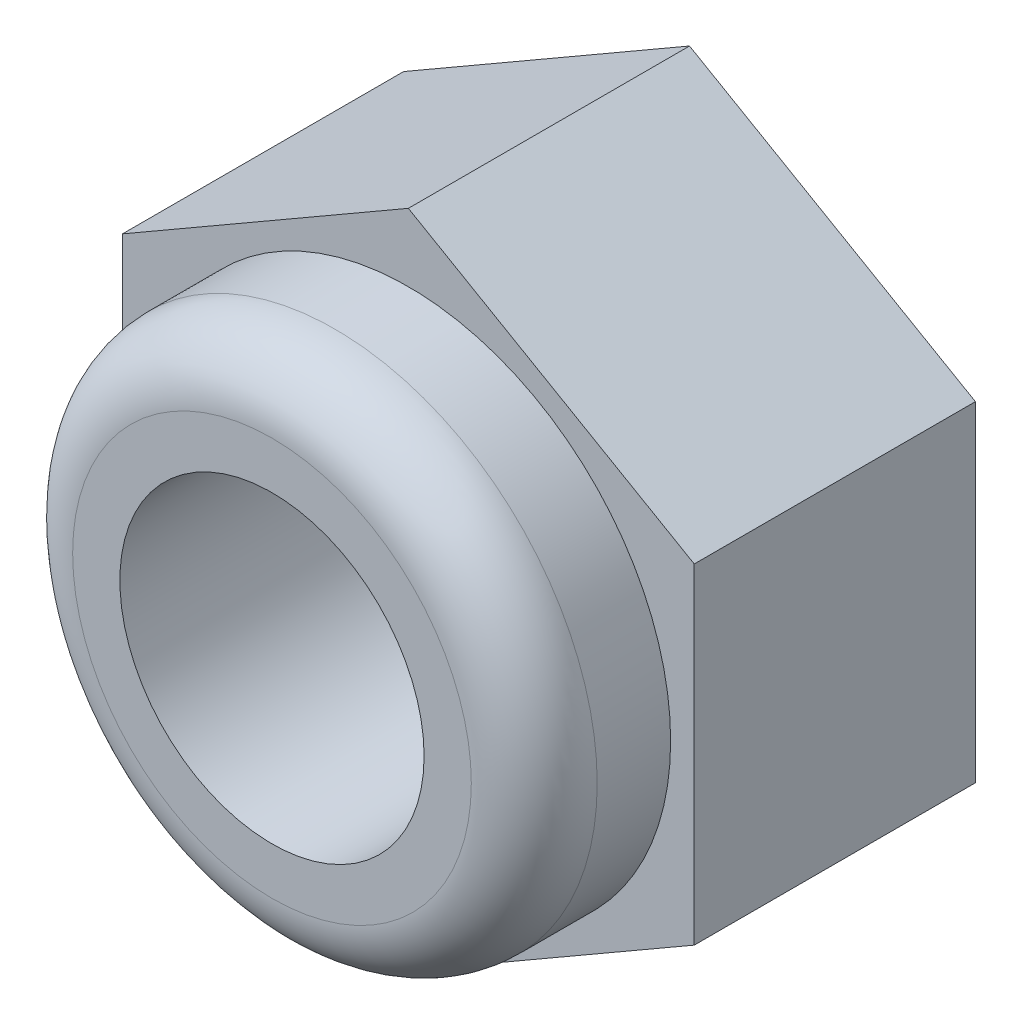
ISO-10303-21;
HEADER;
FILE_DESCRIPTION(('STEP AP214'),'2;1');
FILE_NAME('part.step','',(''),(''),'','','');
FILE_SCHEMA(('AUTOMOTIVE_DESIGN { 1 0 10303 214 1 1 1 1 }'));
ENDSEC;
DATA;
#1=APPLICATION_CONTEXT('core data for automotive mechanical design processes');
#2=APPLICATION_PROTOCOL_DEFINITION('international standard','automotive_design',2000,#1);
#3=PRODUCT_CONTEXT('',#1,'mechanical');
#4=PRODUCT('Part','Part','',(#3));
#5=PRODUCT_RELATED_PRODUCT_CATEGORY('part','',(#4));
#6=PRODUCT_DEFINITION_FORMATION('','',#4);
#7=PRODUCT_DEFINITION_CONTEXT('part definition',#1,'design');
#8=PRODUCT_DEFINITION('design','',#6,#7);
#9=PRODUCT_DEFINITION_SHAPE('','',#8);
#10=(LENGTH_UNIT() NAMED_UNIT(*) SI_UNIT(.MILLI.,.METRE.));
#11=(NAMED_UNIT(*) PLANE_ANGLE_UNIT() SI_UNIT($,.RADIAN.));
#12=(NAMED_UNIT(*) SI_UNIT($,.STERADIAN.) SOLID_ANGLE_UNIT());
#13=UNCERTAINTY_MEASURE_WITH_UNIT(LENGTH_MEASURE(1.E-05),#10,'distance_accuracy_value','');
#14=(GEOMETRIC_REPRESENTATION_CONTEXT(3) GLOBAL_UNCERTAINTY_ASSIGNED_CONTEXT((#13)) GLOBAL_UNIT_ASSIGNED_CONTEXT((#10,
#11,#12)) REPRESENTATION_CONTEXT('',''));
#15=CARTESIAN_POINT('',(0.,0.,0.));
#16=DIRECTION('',(0.,0.,1.));
#17=DIRECTION('',(1.,0.,0.));
#18=AXIS2_PLACEMENT_3D('',#15,#16,#17);
#19=CARTESIAN_POINT('',(-2.725,4.71983845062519,2.68));
#20=DIRECTION('',(0.,0.,1.));
#21=DIRECTION('',(1.,0.,0.));
#22=AXIS2_PLACEMENT_3D('',#19,#20,#21);
#23=PLANE('',#22);
#24=DIRECTION('',(-0.866025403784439,0.5,0.));
#25=VECTOR('',#24,1.);
#26=CARTESIAN_POINT('',(2.725,1.57327948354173,2.68));
#27=LINE('',#26,#25);
#28=CARTESIAN_POINT('',(2.725,1.57327948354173,2.68));
#29=VERTEX_POINT('',#28);
#30=CARTESIAN_POINT('',(0.,3.14655896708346,2.68));
#31=VERTEX_POINT('',#30);
#32=EDGE_CURVE('E134',#29,#31,#27,.T.);
#33=ORIENTED_EDGE('',*,*,#32,.T.);
#34=DIRECTION('',(-0.866025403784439,-0.5,0.));
#35=VECTOR('',#34,1.);
#36=CARTESIAN_POINT('',(0.,3.14655896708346,2.68));
#37=LINE('',#36,#35);
#38=CARTESIAN_POINT('',(-2.725,1.57327948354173,2.68));
#39=VERTEX_POINT('',#38);
#40=EDGE_CURVE('E92',#31,#39,#37,.T.);
#41=ORIENTED_EDGE('',*,*,#40,.T.);
#42=DIRECTION('',(0.,-1.,0.));
#43=VECTOR('',#42,1.);
#44=CARTESIAN_POINT('',(-2.725,1.57327948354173,2.68));
#45=LINE('',#44,#43);
#46=CARTESIAN_POINT('',(-2.725,-1.57327948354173,2.68));
#47=VERTEX_POINT('',#46);
#48=EDGE_CURVE('E105',#39,#47,#45,.T.);
#49=ORIENTED_EDGE('',*,*,#48,.T.);
#50=DIRECTION('',(0.866025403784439,-0.5,0.));
#51=VECTOR('',#50,1.);
#52=CARTESIAN_POINT('',(-2.725,-1.57327948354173,2.68));
#53=LINE('',#52,#51);
#54=CARTESIAN_POINT('',(0.,-3.14655896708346,2.68));
#55=VERTEX_POINT('',#54);
#56=EDGE_CURVE('E99',#47,#55,#53,.T.);
#57=ORIENTED_EDGE('',*,*,#56,.T.);
#58=DIRECTION('',(0.866025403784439,0.5,0.));
#59=VECTOR('',#58,1.);
#60=CARTESIAN_POINT('',(0.,-3.14655896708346,2.68));
#61=LINE('',#60,#59);
#62=CARTESIAN_POINT('',(2.725,-1.57327948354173,2.68));
#63=VERTEX_POINT('',#62);
#64=EDGE_CURVE('E103',#55,#63,#61,.T.);
#65=ORIENTED_EDGE('',*,*,#64,.T.);
#66=DIRECTION('',(0.,1.,0.));
#67=VECTOR('',#66,1.);
#68=CARTESIAN_POINT('',(2.725,-1.57327948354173,2.68));
#69=LINE('',#68,#67);
#70=EDGE_CURVE('E54',#63,#29,#69,.T.);
#71=ORIENTED_EDGE('',*,*,#70,.T.);
#72=EDGE_LOOP('',(#33,#41,#49,#57,#65,#71));
#73=FACE_BOUND('',#72,.T.);
#74=CARTESIAN_POINT('',(0.,0.,2.68));
#75=DIRECTION('',(0.,0.,1.));
#76=DIRECTION('',(1.,0.,0.));
#77=AXIS2_PLACEMENT_3D('',#74,#75,#76);
#78=CIRCLE('',#77,2.5);
#79=CARTESIAN_POINT('',(2.5,0.,2.68));
#80=VERTEX_POINT('',#79);
#81=EDGE_CURVE('E196',#80,#80,#78,.T.);
#82=ORIENTED_EDGE('',*,*,#81,.F.);
#83=EDGE_LOOP('',(#82));
#84=FACE_BOUND('',#83,.T.);
#85=ADVANCED_FACE('F37',(#73,#84),#23,.T.);
#86=CARTESIAN_POINT('',(-2.725,4.71983845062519,0.));
#87=DIRECTION('',(0.,0.,1.));
#88=DIRECTION('',(1.,0.,0.));
#89=AXIS2_PLACEMENT_3D('',#86,#87,#88);
#90=PLANE('',#89);
#91=DIRECTION('',(-0.866025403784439,0.5,0.));
#92=VECTOR('',#91,1.);
#93=CARTESIAN_POINT('',(2.725,1.57327948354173,0.));
#94=LINE('',#93,#92);
#95=CARTESIAN_POINT('',(2.725,1.57327948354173,0.));
#96=VERTEX_POINT('',#95);
#97=CARTESIAN_POINT('',(0.,3.14655896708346,0.));
#98=VERTEX_POINT('',#97);
#99=EDGE_CURVE('E123',#96,#98,#94,.T.);
#100=ORIENTED_EDGE('',*,*,#99,.F.);
#101=DIRECTION('',(0.,1.,0.));
#102=VECTOR('',#101,1.);
#103=CARTESIAN_POINT('',(2.725,-1.57327948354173,0.));
#104=LINE('',#103,#102);
#105=CARTESIAN_POINT('',(2.725,-1.57327948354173,0.));
#106=VERTEX_POINT('',#105);
#107=EDGE_CURVE('E83',#106,#96,#104,.T.);
#108=ORIENTED_EDGE('',*,*,#107,.F.);
#109=DIRECTION('',(0.866025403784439,0.5,0.));
#110=VECTOR('',#109,1.);
#111=CARTESIAN_POINT('',(0.,-3.14655896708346,0.));
#112=LINE('',#111,#110);
#113=CARTESIAN_POINT('',(0.,-3.14655896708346,0.));
#114=VERTEX_POINT('',#113);
#115=EDGE_CURVE('E77',#114,#106,#112,.T.);
#116=ORIENTED_EDGE('',*,*,#115,.F.);
#117=DIRECTION('',(0.866025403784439,-0.5,0.));
#118=VECTOR('',#117,1.);
#119=CARTESIAN_POINT('',(-2.725,-1.57327948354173,0.));
#120=LINE('',#119,#118);
#121=CARTESIAN_POINT('',(-2.725,-1.57327948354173,0.));
#122=VERTEX_POINT('',#121);
#123=EDGE_CURVE('E113',#122,#114,#120,.T.);
#124=ORIENTED_EDGE('',*,*,#123,.F.);
#125=DIRECTION('',(0.,-1.,0.));
#126=VECTOR('',#125,1.);
#127=CARTESIAN_POINT('',(-2.725,1.57327948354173,0.));
#128=LINE('',#127,#126);
#129=CARTESIAN_POINT('',(-2.725,1.57327948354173,0.));
#130=VERTEX_POINT('',#129);
#131=EDGE_CURVE('E129',#130,#122,#128,.T.);
#132=ORIENTED_EDGE('',*,*,#131,.F.);
#133=DIRECTION('',(-0.866025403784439,-0.5,0.));
#134=VECTOR('',#133,1.);
#135=CARTESIAN_POINT('',(0.,3.14655896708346,0.));
#136=LINE('',#135,#134);
#137=EDGE_CURVE('E126',#98,#130,#136,.T.);
#138=ORIENTED_EDGE('',*,*,#137,.F.);
#139=EDGE_LOOP('',(#100,#108,#116,#124,#132,#138));
#140=FACE_BOUND('',#139,.T.);
#141=CARTESIAN_POINT('',(0.,0.,0.));
#142=DIRECTION('',(0.,0.,1.));
#143=DIRECTION('',(1.,0.,0.));
#144=AXIS2_PLACEMENT_3D('',#141,#142,#143);
#145=CIRCLE('',#144,1.45);
#146=CARTESIAN_POINT('',(1.45,0.,0.));
#147=VERTEX_POINT('',#146);
#148=EDGE_CURVE('E127',#147,#147,#145,.T.);
#149=ORIENTED_EDGE('',*,*,#148,.T.);
#150=EDGE_LOOP('',(#149));
#151=FACE_BOUND('',#150,.T.);
#152=ADVANCED_FACE('F158',(#140,#151),#90,.F.);
#153=CARTESIAN_POINT('',(2.725,1.57327948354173,2.68));
#154=DIRECTION('',(-0.5,-0.866025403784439,0.));
#155=DIRECTION('',(0.866025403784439,-0.5,0.));
#156=AXIS2_PLACEMENT_3D('',#153,#154,#155);
#157=PLANE('',#156);
#158=ORIENTED_EDGE('',*,*,#99,.T.);
#159=DIRECTION('',(0.,0.,-1.));
#160=VECTOR('',#159,1.);
#161=CARTESIAN_POINT('',(0.,3.14655896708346,2.68));
#162=LINE('',#161,#160);
#163=EDGE_CURVE('E141',#31,#98,#162,.T.);
#164=ORIENTED_EDGE('',*,*,#163,.F.);
#165=ORIENTED_EDGE('',*,*,#32,.F.);
#166=DIRECTION('',(0.,0.,-1.));
#167=VECTOR('',#166,1.);
#168=CARTESIAN_POINT('',(2.725,1.57327948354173,2.68));
#169=LINE('',#168,#167);
#170=EDGE_CURVE('E119',#29,#96,#169,.T.);
#171=ORIENTED_EDGE('',*,*,#170,.T.);
#172=EDGE_LOOP('',(#158,#164,#165,#171));
#173=FACE_BOUND('',#172,.T.);
#174=ADVANCED_FACE('F163',(#173),#157,.F.);
#175=CARTESIAN_POINT('',(0.,3.14655896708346,2.68));
#176=DIRECTION('',(0.5,-0.866025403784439,0.));
#177=DIRECTION('',(0.866025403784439,0.5,0.));
#178=AXIS2_PLACEMENT_3D('',#175,#176,#177);
#179=PLANE('',#178);
#180=ORIENTED_EDGE('',*,*,#137,.T.);
#181=DIRECTION('',(0.,0.,-1.));
#182=VECTOR('',#181,1.);
#183=CARTESIAN_POINT('',(-2.725,1.57327948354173,2.68));
#184=LINE('',#183,#182);
#185=EDGE_CURVE('E138',#39,#130,#184,.T.);
#186=ORIENTED_EDGE('',*,*,#185,.F.);
#187=ORIENTED_EDGE('',*,*,#40,.F.);
#188=ORIENTED_EDGE('',*,*,#163,.T.);
#189=EDGE_LOOP('',(#180,#186,#187,#188));
#190=FACE_BOUND('',#189,.T.);
#191=ADVANCED_FACE('F179',(#190),#179,.F.);
#192=CARTESIAN_POINT('',(-2.725,1.57327948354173,2.68));
#193=DIRECTION('',(1.,0.,0.));
#194=DIRECTION('',(0.,1.,0.));
#195=AXIS2_PLACEMENT_3D('',#192,#193,#194);
#196=PLANE('',#195);
#197=ORIENTED_EDGE('',*,*,#131,.T.);
#198=DIRECTION('',(0.,0.,-1.));
#199=VECTOR('',#198,1.);
#200=CARTESIAN_POINT('',(-2.725,-1.57327948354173,2.68));
#201=LINE('',#200,#199);
#202=EDGE_CURVE('E114',#47,#122,#201,.T.);
#203=ORIENTED_EDGE('',*,*,#202,.F.);
#204=ORIENTED_EDGE('',*,*,#48,.F.);
#205=ORIENTED_EDGE('',*,*,#185,.T.);
#206=EDGE_LOOP('',(#197,#203,#204,#205));
#207=FACE_BOUND('',#206,.T.);
#208=ADVANCED_FACE('F176',(#207),#196,.F.);
#209=CARTESIAN_POINT('',(-2.725,-1.57327948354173,2.68));
#210=DIRECTION('',(0.5,0.866025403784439,0.));
#211=DIRECTION('',(-0.866025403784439,0.5,0.));
#212=AXIS2_PLACEMENT_3D('',#209,#210,#211);
#213=PLANE('',#212);
#214=ORIENTED_EDGE('',*,*,#123,.T.);
#215=DIRECTION('',(0.,0.,-1.));
#216=VECTOR('',#215,1.);
#217=CARTESIAN_POINT('',(0.,-3.14655896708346,2.68));
#218=LINE('',#217,#216);
#219=EDGE_CURVE('E110',#55,#114,#218,.T.);
#220=ORIENTED_EDGE('',*,*,#219,.F.);
#221=ORIENTED_EDGE('',*,*,#56,.F.);
#222=ORIENTED_EDGE('',*,*,#202,.T.);
#223=EDGE_LOOP('',(#214,#220,#221,#222));
#224=FACE_BOUND('',#223,.T.);
#225=ADVANCED_FACE('F111',(#224),#213,.F.);
#226=CARTESIAN_POINT('',(0.,-3.14655896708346,2.68));
#227=DIRECTION('',(-0.5,0.866025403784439,0.));
#228=DIRECTION('',(-0.866025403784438,-0.5,0.));
#229=AXIS2_PLACEMENT_3D('',#226,#227,#228);
#230=PLANE('',#229);
#231=ORIENTED_EDGE('',*,*,#115,.T.);
#232=DIRECTION('',(0.,0.,-1.));
#233=VECTOR('',#232,1.);
#234=CARTESIAN_POINT('',(2.725,-1.57327948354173,2.68));
#235=LINE('',#234,#233);
#236=EDGE_CURVE('E115',#63,#106,#235,.T.);
#237=ORIENTED_EDGE('',*,*,#236,.F.);
#238=ORIENTED_EDGE('',*,*,#64,.F.);
#239=ORIENTED_EDGE('',*,*,#219,.T.);
#240=EDGE_LOOP('',(#231,#237,#238,#239));
#241=FACE_BOUND('',#240,.T.);
#242=ADVANCED_FACE('F117',(#241),#230,.F.);
#243=CARTESIAN_POINT('',(2.725,-1.57327948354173,2.68));
#244=DIRECTION('',(-1.,0.,0.));
#245=DIRECTION('',(0.,0.,1.));
#246=AXIS2_PLACEMENT_3D('',#243,#244,#245);
#247=PLANE('',#246);
#248=ORIENTED_EDGE('',*,*,#107,.T.);
#249=ORIENTED_EDGE('',*,*,#170,.F.);
#250=ORIENTED_EDGE('',*,*,#70,.F.);
#251=ORIENTED_EDGE('',*,*,#236,.T.);
#252=EDGE_LOOP('',(#248,#249,#250,#251));
#253=FACE_BOUND('',#252,.T.);
#254=ADVANCED_FACE('F169',(#253),#247,.F.);
#255=CARTESIAN_POINT('',(0.,0.,2.68));
#256=DIRECTION('',(0.,0.,-1.));
#257=DIRECTION('',(-1.,0.,0.));
#258=AXIS2_PLACEMENT_3D('',#255,#256,#257);
#259=CYLINDRICAL_SURFACE('',#258,1.45);
#260=ORIENTED_EDGE('',*,*,#148,.F.);
#261=EDGE_LOOP('',(#260));
#262=FACE_BOUND('',#261,.T.);
#263=CARTESIAN_POINT('',(0.,0.,3.98));
#264=DIRECTION('',(0.,0.,1.));
#265=DIRECTION('',(1.,0.,0.));
#266=AXIS2_PLACEMENT_3D('',#263,#264,#265);
#267=CIRCLE('',#266,1.45);
#268=CARTESIAN_POINT('',(1.45,0.,3.98));
#269=VERTEX_POINT('',#268);
#270=EDGE_CURVE('E199',#269,#269,#267,.T.);
#271=ORIENTED_EDGE('',*,*,#270,.T.);
#272=EDGE_LOOP('',(#271));
#273=FACE_BOUND('',#272,.T.);
#274=ADVANCED_FACE('F167',(#262,#273),#259,.F.);
#275=CARTESIAN_POINT('',(0.,0.,3.98));
#276=DIRECTION('',(0.,0.,1.));
#277=DIRECTION('',(1.,0.,0.));
#278=AXIS2_PLACEMENT_3D('',#275,#276,#277);
#279=PLANE('',#278);
#280=CARTESIAN_POINT('',(0.,0.,3.98));
#281=DIRECTION('',(0.,0.,1.));
#282=DIRECTION('',(1.,0.,0.));
#283=AXIS2_PLACEMENT_3D('',#280,#281,#282);
#284=CIRCLE('',#283,1.9);
#285=CARTESIAN_POINT('',(1.9,0.,3.98));
#286=VERTEX_POINT('',#285);
#287=EDGE_CURVE('E46',#286,#286,#284,.T.);
#288=ORIENTED_EDGE('',*,*,#287,.T.);
#289=EDGE_LOOP('',(#288));
#290=FACE_BOUND('',#289,.T.);
#291=ORIENTED_EDGE('',*,*,#270,.F.);
#292=EDGE_LOOP('',(#291));
#293=FACE_BOUND('',#292,.T.);
#294=ADVANCED_FACE('F145',(#290,#293),#279,.T.);
#295=CARTESIAN_POINT('',(0.,0.,3.98));
#296=DIRECTION('',(0.,0.,-1.));
#297=DIRECTION('',(-1.,0.,0.));
#298=AXIS2_PLACEMENT_3D('',#295,#296,#297);
#299=CYLINDRICAL_SURFACE('',#298,2.5);
#300=CARTESIAN_POINT('',(0.,0.,3.38));
#301=DIRECTION('',(0.,0.,1.));
#302=DIRECTION('',(1.,0.,0.));
#303=AXIS2_PLACEMENT_3D('',#300,#301,#302);
#304=CIRCLE('',#303,2.5);
#305=CARTESIAN_POINT('',(2.5,0.,3.38));
#306=VERTEX_POINT('',#305);
#307=EDGE_CURVE('E11',#306,#306,#304,.F.);
#308=ORIENTED_EDGE('',*,*,#307,.T.);
#309=EDGE_LOOP('',(#308));
#310=FACE_BOUND('',#309,.T.);
#311=ORIENTED_EDGE('',*,*,#81,.T.);
#312=EDGE_LOOP('',(#311));
#313=FACE_BOUND('',#312,.T.);
#314=ADVANCED_FACE('F149',(#310,#313),#299,.T.);
#315=CARTESIAN_POINT('',(0.,0.,3.38));
#316=DIRECTION('',(0.,0.,1.));
#317=DIRECTION('',(1.,0.,0.));
#318=AXIS2_PLACEMENT_3D('',#315,#316,#317);
#319=TOROIDAL_SURFACE('',#318,1.9,0.6);
#320=ORIENTED_EDGE('',*,*,#307,.F.);
#321=EDGE_LOOP('',(#320));
#322=FACE_BOUND('',#321,.T.);
#323=ORIENTED_EDGE('',*,*,#287,.F.);
#324=EDGE_LOOP('',(#323));
#325=FACE_BOUND('',#324,.T.);
#326=ADVANCED_FACE('F39',(#322,#325),#319,.T.);
#327=CLOSED_SHELL('',(#85,#152,#174,#191,#208,#225,#242,#254,#274,#294,#314,#326));
#328=MANIFOLD_SOLID_BREP('B2',#327);
#329=ADVANCED_BREP_SHAPE_REPRESENTATION('',(#18,#328),#14);
#330=SHAPE_DEFINITION_REPRESENTATION(#9,#329);
ENDSEC;
END-ISO-10303-21;
